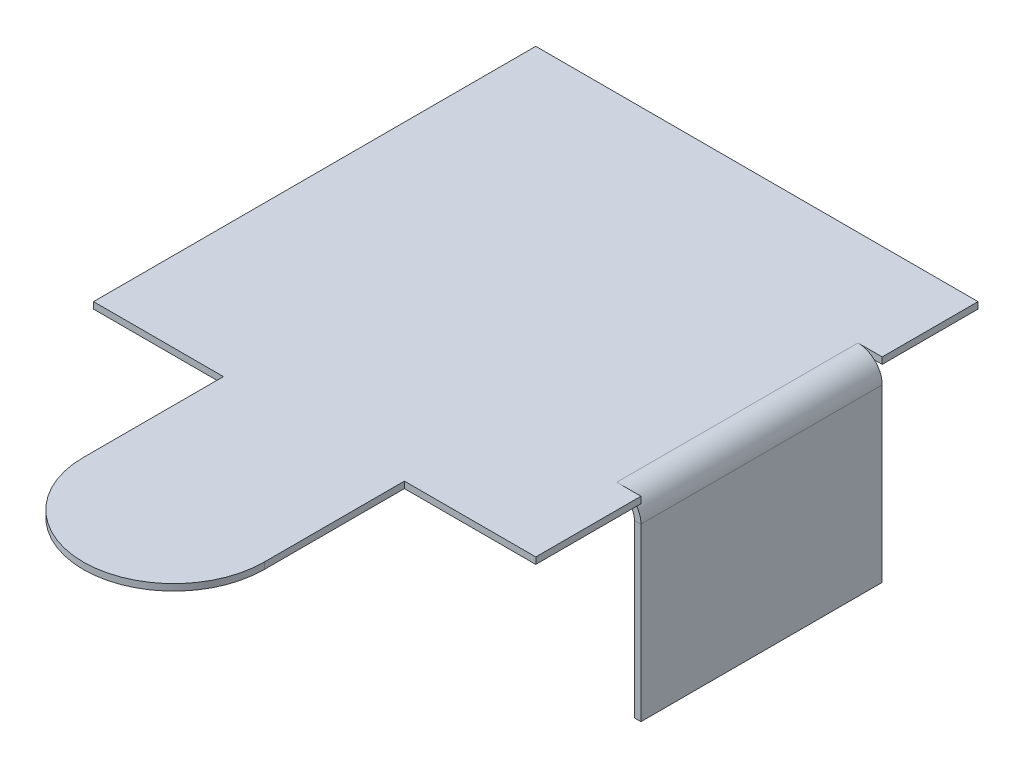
ISO-10303-21;
HEADER;
FILE_DESCRIPTION(('STEP AP214'),'2;1');
FILE_NAME('part.step','',(''),(''),'','','');
FILE_SCHEMA(('AUTOMOTIVE_DESIGN { 1 0 10303 214 1 1 1 1 }'));
ENDSEC;
DATA;
#1=APPLICATION_CONTEXT('core data for automotive mechanical design processes');
#2=APPLICATION_PROTOCOL_DEFINITION('international standard','automotive_design',2000,#1);
#3=PRODUCT_CONTEXT('',#1,'mechanical');
#4=PRODUCT('Part','Part','',(#3));
#5=PRODUCT_RELATED_PRODUCT_CATEGORY('part','',(#4));
#6=PRODUCT_DEFINITION_FORMATION('','',#4);
#7=PRODUCT_DEFINITION_CONTEXT('part definition',#1,'design');
#8=PRODUCT_DEFINITION('design','',#6,#7);
#9=PRODUCT_DEFINITION_SHAPE('','',#8);
#10=(LENGTH_UNIT() NAMED_UNIT(*) SI_UNIT(.MILLI.,.METRE.));
#11=(NAMED_UNIT(*) PLANE_ANGLE_UNIT() SI_UNIT($,.RADIAN.));
#12=(NAMED_UNIT(*) SI_UNIT($,.STERADIAN.) SOLID_ANGLE_UNIT());
#13=UNCERTAINTY_MEASURE_WITH_UNIT(LENGTH_MEASURE(1.E-05),#10,'distance_accuracy_value','');
#14=(GEOMETRIC_REPRESENTATION_CONTEXT(3) GLOBAL_UNCERTAINTY_ASSIGNED_CONTEXT((#13)) GLOBAL_UNIT_ASSIGNED_CONTEXT((#10,
#11,#12)) REPRESENTATION_CONTEXT('',''));
#15=CARTESIAN_POINT('',(0.,0.,0.));
#16=DIRECTION('',(0.,0.,1.));
#17=DIRECTION('',(1.,0.,0.));
#18=AXIS2_PLACEMENT_3D('',#15,#16,#17);
#19=CARTESIAN_POINT('',(50.,-0.7366,50.));
#20=DIRECTION('',(0.,0.,-1.));
#21=DIRECTION('',(-1.,0.,0.));
#22=AXIS2_PLACEMENT_3D('',#19,#20,#21);
#23=PLANE('',#22);
#24=DIRECTION('',(0.,1.,0.));
#25=VECTOR('',#24,1.);
#26=CARTESIAN_POINT('',(35.1486225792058,-0.7366,50.));
#27=LINE('',#26,#25);
#28=CARTESIAN_POINT('',(35.1486225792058,-0.7366,50.));
#29=VERTEX_POINT('',#28);
#30=CARTESIAN_POINT('',(35.1486225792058,0.,50.));
#31=VERTEX_POINT('',#30);
#32=EDGE_CURVE('E156',#29,#31,#27,.T.);
#33=ORIENTED_EDGE('',*,*,#32,.F.);
#34=DIRECTION('',(1.,0.,0.));
#35=VECTOR('',#34,1.);
#36=CARTESIAN_POINT('',(0.,-0.7366,50.));
#37=LINE('',#36,#35);
#38=CARTESIAN_POINT('',(50.,-0.7366,50.));
#39=VERTEX_POINT('',#38);
#40=EDGE_CURVE('E232',#29,#39,#37,.T.);
#41=ORIENTED_EDGE('',*,*,#40,.T.);
#42=DIRECTION('',(0.,-1.,0.));
#43=VECTOR('',#42,1.);
#44=CARTESIAN_POINT('',(50.,0.,50.));
#45=LINE('',#44,#43);
#46=CARTESIAN_POINT('',(50.,0.,50.));
#47=VERTEX_POINT('',#46);
#48=EDGE_CURVE('E178',#47,#39,#45,.T.);
#49=ORIENTED_EDGE('',*,*,#48,.F.);
#50=DIRECTION('',(1.,0.,0.));
#51=VECTOR('',#50,1.);
#52=CARTESIAN_POINT('',(0.,0.,50.));
#53=LINE('',#52,#51);
#54=EDGE_CURVE('E172',#31,#47,#53,.T.);
#55=ORIENTED_EDGE('',*,*,#54,.F.);
#56=EDGE_LOOP('',(#33,#41,#49,#55));
#57=FACE_BOUND('',#56,.T.);
#58=ADVANCED_FACE('F34',(#57),#23,.F.);
#59=CARTESIAN_POINT('',(47.2634,-2.7366,38.1079843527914));
#60=DIRECTION('',(0.,0.,-1.));
#61=DIRECTION('',(-1.,0.,0.));
#62=AXIS2_PLACEMENT_3D('',#59,#60,#61);
#63=PLANE('',#62);
#64=CARTESIAN_POINT('',(47.2634,-2.7366,38.1079843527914));
#65=DIRECTION('',(0.,0.,1.));
#66=DIRECTION('',(1.,0.,0.));
#67=AXIS2_PLACEMENT_3D('',#64,#65,#66);
#68=CIRCLE('',#67,2.7366);
#69=CARTESIAN_POINT('',(50.,-2.73659999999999,38.1079843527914));
#70=VERTEX_POINT('',#69);
#71=CARTESIAN_POINT('',(49.1312810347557,-0.736599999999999,38.1079843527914));
#72=VERTEX_POINT('',#71);
#73=EDGE_CURVE('E227',#70,#72,#68,.T.);
#74=ORIENTED_EDGE('',*,*,#73,.T.);
#75=DIRECTION('',(-1.,0.,0.));
#76=VECTOR('',#75,1.);
#77=CARTESIAN_POINT('',(50.,-0.7366,38.1079843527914));
#78=LINE('',#77,#76);
#79=CARTESIAN_POINT('',(47.2634,-0.736599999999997,38.1079843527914));
#80=VERTEX_POINT('',#79);
#81=EDGE_CURVE('E11',#72,#80,#78,.T.);
#82=ORIENTED_EDGE('',*,*,#81,.T.);
#83=CARTESIAN_POINT('',(47.2634,-2.7366,38.1079843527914));
#84=DIRECTION('',(0.,0.,1.));
#85=DIRECTION('',(1.,0.,0.));
#86=AXIS2_PLACEMENT_3D('',#83,#84,#85);
#87=CIRCLE('',#86,2.);
#88=CARTESIAN_POINT('',(49.2634,-2.73659999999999,38.1079843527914));
#89=VERTEX_POINT('',#88);
#90=EDGE_CURVE('E213',#89,#80,#87,.T.);
#91=ORIENTED_EDGE('',*,*,#90,.F.);
#92=DIRECTION('',(1.,0.,0.));
#93=VECTOR('',#92,1.);
#94=CARTESIAN_POINT('',(49.2634,-2.73659999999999,38.1079843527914));
#95=LINE('',#94,#93);
#96=EDGE_CURVE('E263',#89,#70,#95,.T.);
#97=ORIENTED_EDGE('',*,*,#96,.T.);
#98=EDGE_LOOP('',(#74,#82,#91,#97));
#99=FACE_BOUND('',#98,.T.);
#100=ADVANCED_FACE('F36',(#99),#63,.F.);
#101=CARTESIAN_POINT('',(47.2634,-2.7366,10.8309003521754));
#102=DIRECTION('',(0.,0.,-1.));
#103=DIRECTION('',(-1.,0.,0.));
#104=AXIS2_PLACEMENT_3D('',#101,#102,#103);
#105=PLANE('',#104);
#106=CARTESIAN_POINT('',(47.2634,-2.7366,10.8309003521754));
#107=DIRECTION('',(0.,0.,1.));
#108=DIRECTION('',(1.,0.,0.));
#109=AXIS2_PLACEMENT_3D('',#106,#107,#108);
#110=CIRCLE('',#109,2.);
#111=CARTESIAN_POINT('',(47.2634,-0.736599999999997,10.8309003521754));
#112=VERTEX_POINT('',#111);
#113=CARTESIAN_POINT('',(49.2634,-2.73659999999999,10.8309003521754));
#114=VERTEX_POINT('',#113);
#115=EDGE_CURVE('E214',#112,#114,#110,.F.);
#116=ORIENTED_EDGE('',*,*,#115,.F.);
#117=DIRECTION('',(1.,0.,0.));
#118=VECTOR('',#117,1.);
#119=CARTESIAN_POINT('',(47.2634,-0.736599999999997,10.8309003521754));
#120=LINE('',#119,#118);
#121=CARTESIAN_POINT('',(49.1312810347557,-0.736599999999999,10.8309003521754));
#122=VERTEX_POINT('',#121);
#123=EDGE_CURVE('E253',#112,#122,#120,.T.);
#124=ORIENTED_EDGE('',*,*,#123,.T.);
#125=CARTESIAN_POINT('',(47.2634,-2.7366,10.8309003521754));
#126=DIRECTION('',(0.,0.,1.));
#127=DIRECTION('',(1.,0.,0.));
#128=AXIS2_PLACEMENT_3D('',#125,#126,#127);
#129=CIRCLE('',#128,2.7366);
#130=CARTESIAN_POINT('',(50.,-2.73659999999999,10.8309003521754));
#131=VERTEX_POINT('',#130);
#132=EDGE_CURVE('E226',#122,#131,#129,.F.);
#133=ORIENTED_EDGE('',*,*,#132,.T.);
#134=DIRECTION('',(1.,0.,0.));
#135=VECTOR('',#134,1.);
#136=CARTESIAN_POINT('',(50.,-2.73659999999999,10.8309003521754));
#137=LINE('',#136,#135);
#138=EDGE_CURVE('E257',#114,#131,#137,.T.);
#139=ORIENTED_EDGE('',*,*,#138,.F.);
#140=EDGE_LOOP('',(#116,#124,#133,#139));
#141=FACE_BOUND('',#140,.T.);
#142=ADVANCED_FACE('F338',(#141),#105,.T.);
#143=CARTESIAN_POINT('',(47.2634,-2.7366,38.1079843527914));
#144=DIRECTION('',(0.,0.,1.));
#145=DIRECTION('',(1.,0.,0.));
#146=AXIS2_PLACEMENT_3D('',#143,#144,#145);
#147=CYLINDRICAL_SURFACE('',#146,2.7366);
#148=DIRECTION('',(0.,0.,1.));
#149=VECTOR('',#148,1.);
#150=CARTESIAN_POINT('',(47.2634,0.,38.1079843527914));
#151=LINE('',#150,#149);
#152=CARTESIAN_POINT('',(47.2634,0.,38.1079843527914));
#153=VERTEX_POINT('',#152);
#154=CARTESIAN_POINT('',(47.2634,0.,10.8309003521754));
#155=VERTEX_POINT('',#154);
#156=EDGE_CURVE('E223',#153,#155,#151,.F.);
#157=ORIENTED_EDGE('',*,*,#156,.F.);
#158=EDGE_CURVE('E217',#72,#153,#68,.T.);
#159=ORIENTED_EDGE('',*,*,#158,.F.);
#160=ORIENTED_EDGE('',*,*,#73,.F.);
#161=DIRECTION('',(0.,0.,1.));
#162=VECTOR('',#161,1.);
#163=CARTESIAN_POINT('',(50.,-2.73659999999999,38.1079843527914));
#164=LINE('',#163,#162);
#165=EDGE_CURVE('E266',#131,#70,#164,.T.);
#166=ORIENTED_EDGE('',*,*,#165,.F.);
#167=ORIENTED_EDGE('',*,*,#132,.F.);
#168=EDGE_CURVE('E43',#155,#122,#129,.F.);
#169=ORIENTED_EDGE('',*,*,#168,.F.);
#170=EDGE_LOOP('',(#157,#159,#160,#166,#167,#169));
#171=FACE_BOUND('',#170,.T.);
#172=ADVANCED_FACE('F366',(#171),#147,.T.);
#173=CARTESIAN_POINT('',(47.2634,-2.7366,38.1079843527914));
#174=DIRECTION('',(0.,0.,1.));
#175=DIRECTION('',(1.,0.,0.));
#176=AXIS2_PLACEMENT_3D('',#173,#174,#175);
#177=CYLINDRICAL_SURFACE('',#176,2.);
#178=DIRECTION('',(0.,0.,1.));
#179=VECTOR('',#178,1.);
#180=CARTESIAN_POINT('',(47.2634,-0.736599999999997,38.1079843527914));
#181=LINE('',#180,#179);
#182=EDGE_CURVE('E218',#80,#112,#181,.F.);
#183=ORIENTED_EDGE('',*,*,#182,.T.);
#184=ORIENTED_EDGE('',*,*,#115,.T.);
#185=DIRECTION('',(0.,0.,-1.));
#186=VECTOR('',#185,1.);
#187=CARTESIAN_POINT('',(49.2634,-2.73659999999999,10.8309003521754));
#188=LINE('',#187,#186);
#189=EDGE_CURVE('E260',#114,#89,#188,.F.);
#190=ORIENTED_EDGE('',*,*,#189,.T.);
#191=ORIENTED_EDGE('',*,*,#90,.T.);
#192=EDGE_LOOP('',(#183,#184,#190,#191));
#193=FACE_BOUND('',#192,.T.);
#194=ADVANCED_FACE('F363',(#193),#177,.F.);
#195=CARTESIAN_POINT('',(0.,-0.7366,50.));
#196=DIRECTION('',(0.,1.,0.));
#197=DIRECTION('',(0.,0.,1.));
#198=AXIS2_PLACEMENT_3D('',#195,#196,#197);
#199=PLANE('',#198);
#200=CARTESIAN_POINT('',(50.,-0.7366,38.1079843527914));
#201=VERTEX_POINT('',#200);
#202=EDGE_CURVE('E45',#201,#72,#78,.T.);
#203=ORIENTED_EDGE('',*,*,#202,.F.);
#204=DIRECTION('',(0.,0.,-1.));
#205=VECTOR('',#204,1.);
#206=CARTESIAN_POINT('',(50.,-0.7366,50.));
#207=LINE('',#206,#205);
#208=EDGE_CURVE('E204',#39,#201,#207,.T.);
#209=ORIENTED_EDGE('',*,*,#208,.F.);
#210=ORIENTED_EDGE('',*,*,#40,.F.);
#211=DIRECTION('',(0.,0.,-1.));
#212=VECTOR('',#211,1.);
#213=CARTESIAN_POINT('',(35.1486225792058,-0.7366,50.));
#214=LINE('',#213,#212);
#215=CARTESIAN_POINT('',(35.1486225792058,-0.7366,65.8461090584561));
#216=VERTEX_POINT('',#215);
#217=EDGE_CURVE('E162',#216,#29,#214,.T.);
#218=ORIENTED_EDGE('',*,*,#217,.F.);
#219=CARTESIAN_POINT('',(24.9161270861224,-0.7366,65.8461090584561));
#220=DIRECTION('',(0.,1.,0.));
#221=DIRECTION('',(0.,0.,-1.));
#222=AXIS2_PLACEMENT_3D('',#219,#220,#221);
#223=CIRCLE('',#222,10.2324954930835);
#224=CARTESIAN_POINT('',(14.6836315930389,-0.7366,65.8461090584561));
#225=VERTEX_POINT('',#224);
#226=EDGE_CURVE('E167',#225,#216,#223,.T.);
#227=ORIENTED_EDGE('',*,*,#226,.F.);
#228=DIRECTION('',(0.,0.,1.));
#229=VECTOR('',#228,1.);
#230=CARTESIAN_POINT('',(14.6836315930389,-0.7366,50.));
#231=LINE('',#230,#229);
#232=CARTESIAN_POINT('',(14.6836315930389,-0.7366,50.));
#233=VERTEX_POINT('',#232);
#234=EDGE_CURVE('E299',#233,#225,#231,.T.);
#235=ORIENTED_EDGE('',*,*,#234,.F.);
#236=CARTESIAN_POINT('',(0.,-0.7366,50.));
#237=VERTEX_POINT('',#236);
#238=EDGE_CURVE('E184',#237,#233,#37,.T.);
#239=ORIENTED_EDGE('',*,*,#238,.F.);
#240=DIRECTION('',(0.,0.,-1.));
#241=VECTOR('',#240,1.);
#242=CARTESIAN_POINT('',(0.,-0.7366,50.));
#243=LINE('',#242,#241);
#244=CARTESIAN_POINT('',(0.,-0.7366,0.));
#245=VERTEX_POINT('',#244);
#246=EDGE_CURVE('E196',#237,#245,#243,.T.);
#247=ORIENTED_EDGE('',*,*,#246,.T.);
#248=DIRECTION('',(1.,0.,0.));
#249=VECTOR('',#248,1.);
#250=CARTESIAN_POINT('',(0.,-0.7366,0.));
#251=LINE('',#250,#249);
#252=CARTESIAN_POINT('',(50.,-0.7366,0.));
#253=VERTEX_POINT('',#252);
#254=EDGE_CURVE('E245',#245,#253,#251,.T.);
#255=ORIENTED_EDGE('',*,*,#254,.T.);
#256=CARTESIAN_POINT('',(50.,-0.7366,10.8309003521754));
#257=VERTEX_POINT('',#256);
#258=EDGE_CURVE('E203',#257,#253,#207,.T.);
#259=ORIENTED_EDGE('',*,*,#258,.F.);
#260=EDGE_CURVE('E60',#122,#257,#120,.T.);
#261=ORIENTED_EDGE('',*,*,#260,.F.);
#262=ORIENTED_EDGE('',*,*,#123,.F.);
#263=ORIENTED_EDGE('',*,*,#182,.F.);
#264=ORIENTED_EDGE('',*,*,#81,.F.);
#265=EDGE_LOOP('',(#203,#209,#210,#218,#227,#235,#239,#247,#255,#259,#261,#262,#263,#264));
#266=FACE_BOUND('',#265,.T.);
#267=ADVANCED_FACE('F321',(#266),#199,.F.);
#268=CARTESIAN_POINT('',(50.,0.,50.));
#269=DIRECTION('',(1.,0.,0.));
#270=DIRECTION('',(0.,0.,-1.));
#271=AXIS2_PLACEMENT_3D('',#268,#269,#270);
#272=PLANE('',#271);
#273=ORIENTED_EDGE('',*,*,#208,.T.);
#274=DIRECTION('',(0.,1.,0.));
#275=VECTOR('',#274,1.);
#276=CARTESIAN_POINT('',(50.,-0.7366,38.1079843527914));
#277=LINE('',#276,#275);
#278=CARTESIAN_POINT('',(50.,0.,38.1079843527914));
#279=VERTEX_POINT('',#278);
#280=EDGE_CURVE('E248',#201,#279,#277,.T.);
#281=ORIENTED_EDGE('',*,*,#280,.T.);
#282=DIRECTION('',(0.,0.,-1.));
#283=VECTOR('',#282,1.);
#284=CARTESIAN_POINT('',(50.,0.,50.));
#285=LINE('',#284,#283);
#286=EDGE_CURVE('E201',#47,#279,#285,.T.);
#287=ORIENTED_EDGE('',*,*,#286,.F.);
#288=ORIENTED_EDGE('',*,*,#48,.T.);
#289=EDGE_LOOP('',(#273,#281,#287,#288));
#290=FACE_BOUND('',#289,.T.);
#291=ADVANCED_FACE('F357',(#290),#272,.T.);
#292=CARTESIAN_POINT('',(50.,0.,10.8309003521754));
#293=VERTEX_POINT('',#292);
#294=CARTESIAN_POINT('',(50.,0.,0.));
#295=VERTEX_POINT('',#294);
#296=EDGE_CURVE('E200',#293,#295,#285,.T.);
#297=ORIENTED_EDGE('',*,*,#296,.F.);
#298=DIRECTION('',(0.,1.,0.));
#299=VECTOR('',#298,1.);
#300=CARTESIAN_POINT('',(50.,-0.7366,10.8309003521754));
#301=LINE('',#300,#299);
#302=EDGE_CURVE('E251',#257,#293,#301,.T.);
#303=ORIENTED_EDGE('',*,*,#302,.F.);
#304=ORIENTED_EDGE('',*,*,#258,.T.);
#305=DIRECTION('',(0.,-1.,0.));
#306=VECTOR('',#305,1.);
#307=CARTESIAN_POINT('',(50.,0.,0.));
#308=LINE('',#307,#306);
#309=EDGE_CURVE('E242',#295,#253,#308,.T.);
#310=ORIENTED_EDGE('',*,*,#309,.F.);
#311=EDGE_LOOP('',(#297,#303,#304,#310));
#312=FACE_BOUND('',#311,.T.);
#313=ADVANCED_FACE('F354',(#312),#272,.T.);
#314=CARTESIAN_POINT('',(0.,0.,50.));
#315=DIRECTION('',(0.,1.,0.));
#316=DIRECTION('',(0.,0.,1.));
#317=AXIS2_PLACEMENT_3D('',#314,#315,#316);
#318=PLANE('',#317);
#319=ORIENTED_EDGE('',*,*,#286,.T.);
#320=DIRECTION('',(-1.,0.,0.));
#321=VECTOR('',#320,1.);
#322=CARTESIAN_POINT('',(0.,0.,38.1079843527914));
#323=LINE('',#322,#321);
#324=EDGE_CURVE('E210',#279,#153,#323,.T.);
#325=ORIENTED_EDGE('',*,*,#324,.T.);
#326=ORIENTED_EDGE('',*,*,#156,.T.);
#327=DIRECTION('',(1.,0.,0.));
#328=VECTOR('',#327,1.);
#329=CARTESIAN_POINT('',(0.,0.,10.8309003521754));
#330=LINE('',#329,#328);
#331=EDGE_CURVE('E207',#155,#293,#330,.T.);
#332=ORIENTED_EDGE('',*,*,#331,.T.);
#333=ORIENTED_EDGE('',*,*,#296,.T.);
#334=DIRECTION('',(1.,0.,0.));
#335=VECTOR('',#334,1.);
#336=CARTESIAN_POINT('',(0.,0.,0.));
#337=LINE('',#336,#335);
#338=CARTESIAN_POINT('',(0.,0.,0.));
#339=VERTEX_POINT('',#338);
#340=EDGE_CURVE('E239',#339,#295,#337,.T.);
#341=ORIENTED_EDGE('',*,*,#340,.F.);
#342=DIRECTION('',(0.,0.,-1.));
#343=VECTOR('',#342,1.);
#344=CARTESIAN_POINT('',(0.,0.,50.));
#345=LINE('',#344,#343);
#346=CARTESIAN_POINT('',(0.,0.,50.));
#347=VERTEX_POINT('',#346);
#348=EDGE_CURVE('E198',#347,#339,#345,.T.);
#349=ORIENTED_EDGE('',*,*,#348,.F.);
#350=CARTESIAN_POINT('',(14.6836315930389,0.,50.));
#351=VERTEX_POINT('',#350);
#352=EDGE_CURVE('E179',#347,#351,#53,.T.);
#353=ORIENTED_EDGE('',*,*,#352,.T.);
#354=DIRECTION('',(0.,0.,1.));
#355=VECTOR('',#354,1.);
#356=CARTESIAN_POINT('',(14.6836315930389,0.,50.));
#357=LINE('',#356,#355);
#358=CARTESIAN_POINT('',(14.6836315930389,0.,65.8461090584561));
#359=VERTEX_POINT('',#358);
#360=EDGE_CURVE('E52',#351,#359,#357,.T.);
#361=ORIENTED_EDGE('',*,*,#360,.T.);
#362=CARTESIAN_POINT('',(24.9161270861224,0.,65.8461090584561));
#363=DIRECTION('',(0.,1.,0.));
#364=DIRECTION('',(0.,0.,-1.));
#365=AXIS2_PLACEMENT_3D('',#362,#363,#364);
#366=CIRCLE('',#365,10.2324954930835);
#367=CARTESIAN_POINT('',(35.1486225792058,0.,65.8461090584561));
#368=VERTEX_POINT('',#367);
#369=EDGE_CURVE('E175',#359,#368,#366,.T.);
#370=ORIENTED_EDGE('',*,*,#369,.T.);
#371=DIRECTION('',(0.,0.,-1.));
#372=VECTOR('',#371,1.);
#373=CARTESIAN_POINT('',(35.1486225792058,0.,50.));
#374=LINE('',#373,#372);
#375=EDGE_CURVE('E159',#368,#31,#374,.T.);
#376=ORIENTED_EDGE('',*,*,#375,.T.);
#377=ORIENTED_EDGE('',*,*,#54,.T.);
#378=EDGE_LOOP('',(#319,#325,#326,#332,#333,#341,#349,#353,#361,#370,#376,#377));
#379=FACE_BOUND('',#378,.T.);
#380=ADVANCED_FACE('F171',(#379),#318,.T.);
#381=CARTESIAN_POINT('',(0.,-0.7366,50.));
#382=DIRECTION('',(-1.,0.,0.));
#383=DIRECTION('',(0.,0.,1.));
#384=AXIS2_PLACEMENT_3D('',#381,#382,#383);
#385=PLANE('',#384);
#386=DIRECTION('',(0.,1.,0.));
#387=VECTOR('',#386,1.);
#388=CARTESIAN_POINT('',(0.,-0.7366,0.));
#389=LINE('',#388,#387);
#390=EDGE_CURVE('E235',#245,#339,#389,.T.);
#391=ORIENTED_EDGE('',*,*,#390,.F.);
#392=ORIENTED_EDGE('',*,*,#246,.F.);
#393=DIRECTION('',(0.,1.,0.));
#394=VECTOR('',#393,1.);
#395=CARTESIAN_POINT('',(0.,-0.7366,50.));
#396=LINE('',#395,#394);
#397=EDGE_CURVE('E182',#237,#347,#396,.T.);
#398=ORIENTED_EDGE('',*,*,#397,.T.);
#399=ORIENTED_EDGE('',*,*,#348,.T.);
#400=EDGE_LOOP('',(#391,#392,#398,#399));
#401=FACE_BOUND('',#400,.T.);
#402=ADVANCED_FACE('F318',(#401),#385,.T.);
#403=ORIENTED_EDGE('',*,*,#238,.T.);
#404=DIRECTION('',(0.,1.,0.));
#405=VECTOR('',#404,1.);
#406=CARTESIAN_POINT('',(14.6836315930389,-0.7366,50.));
#407=LINE('',#406,#405);
#408=EDGE_CURVE('E166',#233,#351,#407,.T.);
#409=ORIENTED_EDGE('',*,*,#408,.T.);
#410=ORIENTED_EDGE('',*,*,#352,.F.);
#411=ORIENTED_EDGE('',*,*,#397,.F.);
#412=EDGE_LOOP('',(#403,#409,#410,#411));
#413=FACE_BOUND('',#412,.T.);
#414=ADVANCED_FACE('F311',(#413),#23,.F.);
#415=CARTESIAN_POINT('',(50.,-0.7366,0.));
#416=DIRECTION('',(0.,0.,-1.));
#417=DIRECTION('',(-1.,0.,0.));
#418=AXIS2_PLACEMENT_3D('',#415,#416,#417);
#419=PLANE('',#418);
#420=ORIENTED_EDGE('',*,*,#254,.F.);
#421=ORIENTED_EDGE('',*,*,#390,.T.);
#422=ORIENTED_EDGE('',*,*,#340,.T.);
#423=ORIENTED_EDGE('',*,*,#309,.T.);
#424=EDGE_LOOP('',(#420,#421,#422,#423));
#425=FACE_BOUND('',#424,.T.);
#426=ADVANCED_FACE('F343',(#425),#419,.T.);
#427=CARTESIAN_POINT('',(50.,-0.7366,38.1079843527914));
#428=DIRECTION('',(0.,0.,-1.));
#429=DIRECTION('',(0.,1.,0.));
#430=AXIS2_PLACEMENT_3D('',#427,#428,#429);
#431=PLANE('',#430);
#432=ORIENTED_EDGE('',*,*,#202,.T.);
#433=ORIENTED_EDGE('',*,*,#158,.T.);
#434=ORIENTED_EDGE('',*,*,#324,.F.);
#435=ORIENTED_EDGE('',*,*,#280,.F.);
#436=EDGE_LOOP('',(#432,#433,#434,#435));
#437=FACE_BOUND('',#436,.T.);
#438=ADVANCED_FACE('F348',(#437),#431,.T.);
#439=CARTESIAN_POINT('',(47.2634,-0.736599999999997,10.8309003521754));
#440=DIRECTION('',(0.,0.,1.));
#441=DIRECTION('',(0.,-1.,0.));
#442=AXIS2_PLACEMENT_3D('',#439,#440,#441);
#443=PLANE('',#442);
#444=ORIENTED_EDGE('',*,*,#331,.F.);
#445=ORIENTED_EDGE('',*,*,#168,.T.);
#446=ORIENTED_EDGE('',*,*,#260,.T.);
#447=ORIENTED_EDGE('',*,*,#302,.T.);
#448=EDGE_LOOP('',(#444,#445,#446,#447));
#449=FACE_BOUND('',#448,.T.);
#450=ADVANCED_FACE('F350',(#449),#443,.T.);
#451=CARTESIAN_POINT('',(50.,-0.736599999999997,38.1079843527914));
#452=DIRECTION('',(0.,0.,1.));
#453=DIRECTION('',(1.,0.,0.));
#454=AXIS2_PLACEMENT_3D('',#451,#452,#453);
#455=PLANE('',#454);
#456=DIRECTION('',(0.,1.,0.));
#457=VECTOR('',#456,1.);
#458=CARTESIAN_POINT('',(50.,-0.736599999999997,38.1079843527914));
#459=LINE('',#458,#457);
#460=CARTESIAN_POINT('',(50.0000000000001,-22.0807213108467,38.1079843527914));
#461=VERTEX_POINT('',#460);
#462=EDGE_CURVE('E277',#461,#70,#459,.T.);
#463=ORIENTED_EDGE('',*,*,#462,.T.);
#464=ORIENTED_EDGE('',*,*,#96,.F.);
#465=DIRECTION('',(0.,-1.,0.));
#466=VECTOR('',#465,1.);
#467=CARTESIAN_POINT('',(49.2634000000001,-22.0807213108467,38.1079843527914));
#468=LINE('',#467,#466);
#469=CARTESIAN_POINT('',(49.2634000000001,-22.0807213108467,38.1079843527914));
#470=VERTEX_POINT('',#469);
#471=EDGE_CURVE('E269',#470,#89,#468,.F.);
#472=ORIENTED_EDGE('',*,*,#471,.F.);
#473=DIRECTION('',(-1.,0.,0.));
#474=VECTOR('',#473,1.);
#475=CARTESIAN_POINT('',(50.0000000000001,-22.0807213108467,38.1079843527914));
#476=LINE('',#475,#474);
#477=EDGE_CURVE('E288',#461,#470,#476,.T.);
#478=ORIENTED_EDGE('',*,*,#477,.F.);
#479=EDGE_LOOP('',(#463,#464,#472,#478));
#480=FACE_BOUND('',#479,.T.);
#481=ADVANCED_FACE('F393',(#480),#455,.T.);
#482=CARTESIAN_POINT('',(50.0000000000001,-22.0807213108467,10.8309003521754));
#483=DIRECTION('',(0.,0.,-1.));
#484=DIRECTION('',(0.,1.,0.));
#485=AXIS2_PLACEMENT_3D('',#482,#483,#484);
#486=PLANE('',#485);
#487=DIRECTION('',(0.,1.,0.));
#488=VECTOR('',#487,1.);
#489=CARTESIAN_POINT('',(49.2634000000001,-22.0807213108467,10.8309003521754));
#490=LINE('',#489,#488);
#491=CARTESIAN_POINT('',(49.2634000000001,-22.0807213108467,10.8309003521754));
#492=VERTEX_POINT('',#491);
#493=EDGE_CURVE('E272',#114,#492,#490,.F.);
#494=ORIENTED_EDGE('',*,*,#493,.F.);
#495=ORIENTED_EDGE('',*,*,#138,.T.);
#496=DIRECTION('',(0.,-1.,0.));
#497=VECTOR('',#496,1.);
#498=CARTESIAN_POINT('',(50.0000000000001,-22.0807213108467,10.8309003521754));
#499=LINE('',#498,#497);
#500=CARTESIAN_POINT('',(50.0000000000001,-22.0807213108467,10.8309003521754));
#501=VERTEX_POINT('',#500);
#502=EDGE_CURVE('E280',#131,#501,#499,.T.);
#503=ORIENTED_EDGE('',*,*,#502,.T.);
#504=DIRECTION('',(-1.,0.,0.));
#505=VECTOR('',#504,1.);
#506=CARTESIAN_POINT('',(50.0000000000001,-22.0807213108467,10.8309003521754));
#507=LINE('',#506,#505);
#508=EDGE_CURVE('E285',#501,#492,#507,.T.);
#509=ORIENTED_EDGE('',*,*,#508,.T.);
#510=EDGE_LOOP('',(#494,#495,#503,#509));
#511=FACE_BOUND('',#510,.T.);
#512=ADVANCED_FACE('F384',(#511),#486,.T.);
#513=CARTESIAN_POINT('',(50.0000000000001,-22.0807213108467,38.1079843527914));
#514=DIRECTION('',(1.,0.,0.));
#515=DIRECTION('',(0.,1.,0.));
#516=AXIS2_PLACEMENT_3D('',#513,#514,#515);
#517=PLANE('',#516);
#518=ORIENTED_EDGE('',*,*,#502,.F.);
#519=ORIENTED_EDGE('',*,*,#165,.T.);
#520=ORIENTED_EDGE('',*,*,#462,.F.);
#521=DIRECTION('',(0.,0.,1.));
#522=VECTOR('',#521,1.);
#523=CARTESIAN_POINT('',(50.0000000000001,-22.0807213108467,38.1079843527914));
#524=LINE('',#523,#522);
#525=EDGE_CURVE('E282',#501,#461,#524,.T.);
#526=ORIENTED_EDGE('',*,*,#525,.F.);
#527=EDGE_LOOP('',(#518,#519,#520,#526));
#528=FACE_BOUND('',#527,.T.);
#529=ADVANCED_FACE('F396',(#528),#517,.T.);
#530=CARTESIAN_POINT('',(49.2634000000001,-22.0807213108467,38.1079843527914));
#531=DIRECTION('',(1.,0.,0.));
#532=DIRECTION('',(0.,1.,0.));
#533=AXIS2_PLACEMENT_3D('',#530,#531,#532);
#534=PLANE('',#533);
#535=ORIENTED_EDGE('',*,*,#189,.F.);
#536=ORIENTED_EDGE('',*,*,#493,.T.);
#537=DIRECTION('',(0.,0.,-1.));
#538=VECTOR('',#537,1.);
#539=CARTESIAN_POINT('',(49.2634000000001,-22.0807213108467,38.1079843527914));
#540=LINE('',#539,#538);
#541=EDGE_CURVE('E274',#492,#470,#540,.F.);
#542=ORIENTED_EDGE('',*,*,#541,.T.);
#543=ORIENTED_EDGE('',*,*,#471,.T.);
#544=EDGE_LOOP('',(#535,#536,#542,#543));
#545=FACE_BOUND('',#544,.T.);
#546=ADVANCED_FACE('F380',(#545),#534,.F.);
#547=CARTESIAN_POINT('',(50.0000000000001,-22.0807213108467,38.1079843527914));
#548=DIRECTION('',(0.,-1.,0.));
#549=DIRECTION('',(1.,0.,0.));
#550=AXIS2_PLACEMENT_3D('',#547,#548,#549);
#551=PLANE('',#550);
#552=ORIENTED_EDGE('',*,*,#541,.F.);
#553=ORIENTED_EDGE('',*,*,#508,.F.);
#554=ORIENTED_EDGE('',*,*,#525,.T.);
#555=ORIENTED_EDGE('',*,*,#477,.T.);
#556=EDGE_LOOP('',(#552,#553,#554,#555));
#557=FACE_BOUND('',#556,.T.);
#558=ADVANCED_FACE('F390',(#557),#551,.T.);
#559=CARTESIAN_POINT('',(35.1486225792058,-0.7366,50.));
#560=DIRECTION('',(1.,0.,0.));
#561=DIRECTION('',(0.,0.,-1.));
#562=AXIS2_PLACEMENT_3D('',#559,#560,#561);
#563=PLANE('',#562);
#564=ORIENTED_EDGE('',*,*,#375,.F.);
#565=DIRECTION('',(0.,1.,0.));
#566=VECTOR('',#565,1.);
#567=CARTESIAN_POINT('',(35.1486225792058,-0.7366,65.8461090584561));
#568=LINE('',#567,#566);
#569=EDGE_CURVE('E261',#216,#368,#568,.T.);
#570=ORIENTED_EDGE('',*,*,#569,.F.);
#571=ORIENTED_EDGE('',*,*,#217,.T.);
#572=ORIENTED_EDGE('',*,*,#32,.T.);
#573=EDGE_LOOP('',(#564,#570,#571,#572));
#574=FACE_BOUND('',#573,.T.);
#575=ADVANCED_FACE('F158',(#574),#563,.T.);
#576=CARTESIAN_POINT('',(24.9161270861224,-0.7366,65.8461090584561));
#577=DIRECTION('',(0.,1.,0.));
#578=DIRECTION('',(0.,0.,1.));
#579=AXIS2_PLACEMENT_3D('',#576,#577,#578);
#580=CYLINDRICAL_SURFACE('',#579,10.2324954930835);
#581=ORIENTED_EDGE('',*,*,#369,.F.);
#582=DIRECTION('',(0.,1.,0.));
#583=VECTOR('',#582,1.);
#584=CARTESIAN_POINT('',(14.6836315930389,-0.7366,65.8461090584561));
#585=LINE('',#584,#583);
#586=EDGE_CURVE('E306',#225,#359,#585,.T.);
#587=ORIENTED_EDGE('',*,*,#586,.F.);
#588=ORIENTED_EDGE('',*,*,#226,.T.);
#589=ORIENTED_EDGE('',*,*,#569,.T.);
#590=EDGE_LOOP('',(#581,#587,#588,#589));
#591=FACE_BOUND('',#590,.T.);
#592=ADVANCED_FACE('F325',(#591),#580,.T.);
#593=CARTESIAN_POINT('',(14.6836315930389,-0.7366,50.));
#594=DIRECTION('',(-1.,0.,0.));
#595=DIRECTION('',(0.,0.,1.));
#596=AXIS2_PLACEMENT_3D('',#593,#594,#595);
#597=PLANE('',#596);
#598=ORIENTED_EDGE('',*,*,#360,.F.);
#599=ORIENTED_EDGE('',*,*,#408,.F.);
#600=ORIENTED_EDGE('',*,*,#234,.T.);
#601=ORIENTED_EDGE('',*,*,#586,.T.);
#602=EDGE_LOOP('',(#598,#599,#600,#601));
#603=FACE_BOUND('',#602,.T.);
#604=ADVANCED_FACE('F323',(#603),#597,.T.);
#605=CLOSED_SHELL('',(#58,#100,#142,#172,#194,#267,#291,#313,#380,#402,#414,#426,#438,#450,#481,
#512,#529,#546,#558,#575,#592,#604));
#606=MANIFOLD_SOLID_BREP('B2',#605);
#607=ADVANCED_BREP_SHAPE_REPRESENTATION('',(#18,#606),#14);
#608=SHAPE_DEFINITION_REPRESENTATION(#9,#607);
ENDSEC;
END-ISO-10303-21;
